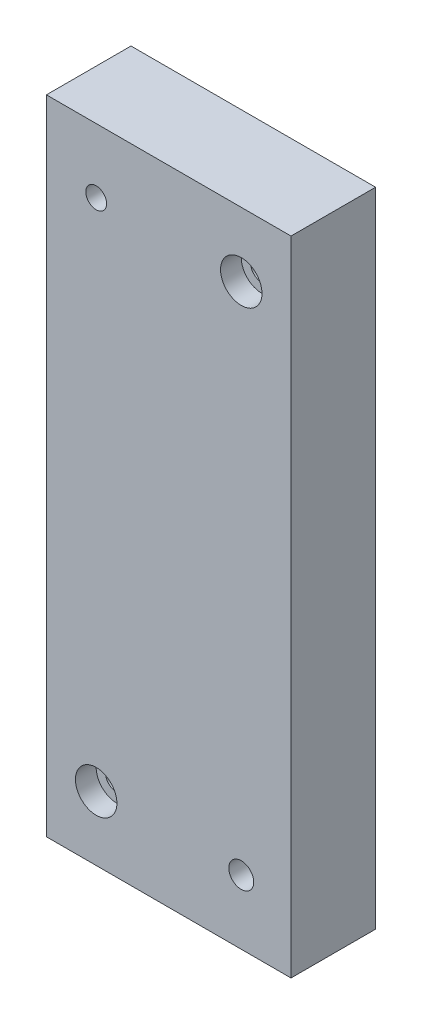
ISO-10303-21;
HEADER;
FILE_DESCRIPTION(('STEP AP214'),'2;1');
FILE_NAME('part.step','',(''),(''),'','','');
FILE_SCHEMA(('AUTOMOTIVE_DESIGN { 1 0 10303 214 1 1 1 1 }'));
ENDSEC;
DATA;
#1=APPLICATION_CONTEXT('core data for automotive mechanical design processes');
#2=APPLICATION_PROTOCOL_DEFINITION('international standard','automotive_design',2000,#1);
#3=PRODUCT_CONTEXT('',#1,'mechanical');
#4=PRODUCT('Part','Part','',(#3));
#5=PRODUCT_RELATED_PRODUCT_CATEGORY('part','',(#4));
#6=PRODUCT_DEFINITION_FORMATION('','',#4);
#7=PRODUCT_DEFINITION_CONTEXT('part definition',#1,'design');
#8=PRODUCT_DEFINITION('design','',#6,#7);
#9=PRODUCT_DEFINITION_SHAPE('','',#8);
#10=(LENGTH_UNIT() NAMED_UNIT(*) SI_UNIT(.MILLI.,.METRE.));
#11=(NAMED_UNIT(*) PLANE_ANGLE_UNIT() SI_UNIT($,.RADIAN.));
#12=(NAMED_UNIT(*) SI_UNIT($,.STERADIAN.) SOLID_ANGLE_UNIT());
#13=UNCERTAINTY_MEASURE_WITH_UNIT(LENGTH_MEASURE(1.E-05),#10,'distance_accuracy_value','');
#14=(GEOMETRIC_REPRESENTATION_CONTEXT(3) GLOBAL_UNCERTAINTY_ASSIGNED_CONTEXT((#13)) GLOBAL_UNIT_ASSIGNED_CONTEXT((#10,
#11,#12)) REPRESENTATION_CONTEXT('',''));
#15=CARTESIAN_POINT('',(0.,0.,0.));
#16=DIRECTION('',(0.,0.,1.));
#17=DIRECTION('',(1.,0.,0.));
#18=AXIS2_PLACEMENT_3D('',#15,#16,#17);
#19=CARTESIAN_POINT('',(29.5,77.5,20.4));
#20=DIRECTION('',(0.,0.,1.));
#21=DIRECTION('',(1.,0.,0.));
#22=AXIS2_PLACEMENT_3D('',#19,#20,#21);
#23=PLANE('',#22);
#24=CARTESIAN_POINT('',(17.5,62.,20.4));
#25=DIRECTION('',(0.,0.,1.));
#26=DIRECTION('',(1.,0.,0.));
#27=AXIS2_PLACEMENT_3D('',#24,#25,#26);
#28=CIRCLE('',#27,4.99999999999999);
#29=CARTESIAN_POINT('',(22.5,62.,20.4));
#30=VERTEX_POINT('',#29);
#31=EDGE_CURVE('E138',#30,#30,#28,.T.);
#32=ORIENTED_EDGE('',*,*,#31,.F.);
#33=EDGE_LOOP('',(#32));
#34=FACE_BOUND('',#33,.T.);
#35=CARTESIAN_POINT('',(-17.5,-62.,20.4));
#36=DIRECTION('',(0.,0.,1.));
#37=DIRECTION('',(1.,0.,0.));
#38=AXIS2_PLACEMENT_3D('',#35,#36,#37);
#39=CIRCLE('',#38,4.99999999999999);
#40=CARTESIAN_POINT('',(-12.5,-62.,20.4));
#41=VERTEX_POINT('',#40);
#42=EDGE_CURVE('E124',#41,#41,#39,.T.);
#43=ORIENTED_EDGE('',*,*,#42,.F.);
#44=EDGE_LOOP('',(#43));
#45=FACE_BOUND('',#44,.T.);
#46=CARTESIAN_POINT('',(-17.5,62.,20.4));
#47=DIRECTION('',(0.,0.,1.));
#48=DIRECTION('',(1.,0.,0.));
#49=AXIS2_PLACEMENT_3D('',#46,#47,#48);
#50=CIRCLE('',#49,2.5035);
#51=CARTESIAN_POINT('',(-14.9965,62.,20.4));
#52=VERTEX_POINT('',#51);
#53=EDGE_CURVE('E90',#52,#52,#50,.T.);
#54=ORIENTED_EDGE('',*,*,#53,.F.);
#55=EDGE_LOOP('',(#54));
#56=FACE_BOUND('',#55,.T.);
#57=DIRECTION('',(0.,1.,0.));
#58=VECTOR('',#57,1.);
#59=CARTESIAN_POINT('',(29.5,-77.5,20.4));
#60=LINE('',#59,#58);
#61=CARTESIAN_POINT('',(29.5,-77.5,20.4));
#62=VERTEX_POINT('',#61);
#63=CARTESIAN_POINT('',(29.5,77.5,20.4));
#64=VERTEX_POINT('',#63);
#65=EDGE_CURVE('E100',#62,#64,#60,.T.);
#66=ORIENTED_EDGE('',*,*,#65,.T.);
#67=DIRECTION('',(-1.,0.,0.));
#68=VECTOR('',#67,1.);
#69=CARTESIAN_POINT('',(29.5,77.5,20.4));
#70=LINE('',#69,#68);
#71=CARTESIAN_POINT('',(-29.5,77.5,20.4));
#72=VERTEX_POINT('',#71);
#73=EDGE_CURVE('E85',#64,#72,#70,.T.);
#74=ORIENTED_EDGE('',*,*,#73,.T.);
#75=DIRECTION('',(0.,-1.,0.));
#76=VECTOR('',#75,1.);
#77=CARTESIAN_POINT('',(-29.5,-77.5,20.4));
#78=LINE('',#77,#76);
#79=CARTESIAN_POINT('',(-29.5,-77.5,20.4));
#80=VERTEX_POINT('',#79);
#81=EDGE_CURVE('E51',#72,#80,#78,.T.);
#82=ORIENTED_EDGE('',*,*,#81,.T.);
#83=DIRECTION('',(1.,0.,0.));
#84=VECTOR('',#83,1.);
#85=CARTESIAN_POINT('',(-29.5,-77.5,20.4));
#86=LINE('',#85,#84);
#87=EDGE_CURVE('E46',#80,#62,#86,.T.);
#88=ORIENTED_EDGE('',*,*,#87,.T.);
#89=EDGE_LOOP('',(#66,#74,#82,#88));
#90=FACE_BOUND('',#89,.T.);
#91=CARTESIAN_POINT('',(17.5,-62.,20.4));
#92=DIRECTION('',(0.,0.,1.));
#93=DIRECTION('',(1.,0.,0.));
#94=AXIS2_PLACEMENT_3D('',#91,#92,#93);
#95=CIRCLE('',#94,3.0035);
#96=CARTESIAN_POINT('',(20.5035,-62.,20.4));
#97=VERTEX_POINT('',#96);
#98=EDGE_CURVE('E118',#97,#97,#95,.T.);
#99=ORIENTED_EDGE('',*,*,#98,.F.);
#100=EDGE_LOOP('',(#99));
#101=FACE_BOUND('',#100,.T.);
#102=ADVANCED_FACE('F31',(#34,#45,#56,#90,#101),#23,.T.);
#103=CARTESIAN_POINT('',(29.5,77.5,0.));
#104=DIRECTION('',(0.,0.,1.));
#105=DIRECTION('',(1.,0.,0.));
#106=AXIS2_PLACEMENT_3D('',#103,#104,#105);
#107=PLANE('',#106);
#108=CARTESIAN_POINT('',(17.5,62.,0.));
#109=DIRECTION('',(0.,0.,1.));
#110=DIRECTION('',(1.,0.,0.));
#111=AXIS2_PLACEMENT_3D('',#108,#109,#110);
#112=CIRCLE('',#111,2.75);
#113=CARTESIAN_POINT('',(20.25,62.,0.));
#114=VERTEX_POINT('',#113);
#115=EDGE_CURVE('E147',#114,#114,#112,.T.);
#116=ORIENTED_EDGE('',*,*,#115,.T.);
#117=EDGE_LOOP('',(#116));
#118=FACE_BOUND('',#117,.T.);
#119=CARTESIAN_POINT('',(-17.5,-62.,0.));
#120=DIRECTION('',(0.,0.,1.));
#121=DIRECTION('',(1.,0.,0.));
#122=AXIS2_PLACEMENT_3D('',#119,#120,#121);
#123=CIRCLE('',#122,2.75);
#124=CARTESIAN_POINT('',(-14.75,-62.,0.));
#125=VERTEX_POINT('',#124);
#126=EDGE_CURVE('E135',#125,#125,#123,.T.);
#127=ORIENTED_EDGE('',*,*,#126,.T.);
#128=EDGE_LOOP('',(#127));
#129=FACE_BOUND('',#128,.T.);
#130=CARTESIAN_POINT('',(-17.5,62.,0.));
#131=DIRECTION('',(0.,0.,1.));
#132=DIRECTION('',(1.,0.,0.));
#133=AXIS2_PLACEMENT_3D('',#130,#131,#132);
#134=CIRCLE('',#133,2.5035);
#135=CARTESIAN_POINT('',(-14.9965,62.,0.));
#136=VERTEX_POINT('',#135);
#137=EDGE_CURVE('E93',#136,#136,#134,.T.);
#138=ORIENTED_EDGE('',*,*,#137,.T.);
#139=EDGE_LOOP('',(#138));
#140=FACE_BOUND('',#139,.T.);
#141=DIRECTION('',(0.,1.,0.));
#142=VECTOR('',#141,1.);
#143=CARTESIAN_POINT('',(29.5,-77.5,0.));
#144=LINE('',#143,#142);
#145=CARTESIAN_POINT('',(29.5,-77.5,0.));
#146=VERTEX_POINT('',#145);
#147=CARTESIAN_POINT('',(29.5,77.5,0.));
#148=VERTEX_POINT('',#147);
#149=EDGE_CURVE('E77',#146,#148,#144,.T.);
#150=ORIENTED_EDGE('',*,*,#149,.F.);
#151=DIRECTION('',(1.,0.,0.));
#152=VECTOR('',#151,1.);
#153=CARTESIAN_POINT('',(-29.5,-77.5,0.));
#154=LINE('',#153,#152);
#155=CARTESIAN_POINT('',(-29.5,-77.5,0.));
#156=VERTEX_POINT('',#155);
#157=EDGE_CURVE('E98',#156,#146,#154,.T.);
#158=ORIENTED_EDGE('',*,*,#157,.F.);
#159=DIRECTION('',(0.,-1.,0.));
#160=VECTOR('',#159,1.);
#161=CARTESIAN_POINT('',(-29.5,-77.5,0.));
#162=LINE('',#161,#160);
#163=CARTESIAN_POINT('',(-29.5,77.5,0.));
#164=VERTEX_POINT('',#163);
#165=EDGE_CURVE('E78',#164,#156,#162,.T.);
#166=ORIENTED_EDGE('',*,*,#165,.F.);
#167=DIRECTION('',(-1.,0.,0.));
#168=VECTOR('',#167,1.);
#169=CARTESIAN_POINT('',(29.5,77.5,0.));
#170=LINE('',#169,#168);
#171=EDGE_CURVE('E72',#148,#164,#170,.T.);
#172=ORIENTED_EDGE('',*,*,#171,.F.);
#173=EDGE_LOOP('',(#150,#158,#166,#172));
#174=FACE_BOUND('',#173,.T.);
#175=CARTESIAN_POINT('',(17.5,-62.,0.));
#176=DIRECTION('',(0.,0.,1.));
#177=DIRECTION('',(1.,0.,0.));
#178=AXIS2_PLACEMENT_3D('',#175,#176,#177);
#179=CIRCLE('',#178,3.0035);
#180=CARTESIAN_POINT('',(20.5035,-62.,0.));
#181=VERTEX_POINT('',#180);
#182=EDGE_CURVE('E120',#181,#181,#179,.T.);
#183=ORIENTED_EDGE('',*,*,#182,.T.);
#184=EDGE_LOOP('',(#183));
#185=FACE_BOUND('',#184,.T.);
#186=ADVANCED_FACE('F73',(#118,#129,#140,#174,#185),#107,.F.);
#187=CARTESIAN_POINT('',(29.5,-77.5,20.4));
#188=DIRECTION('',(-1.,0.,0.));
#189=DIRECTION('',(0.,0.,1.));
#190=AXIS2_PLACEMENT_3D('',#187,#188,#189);
#191=PLANE('',#190);
#192=ORIENTED_EDGE('',*,*,#149,.T.);
#193=DIRECTION('',(0.,0.,-1.));
#194=VECTOR('',#193,1.);
#195=CARTESIAN_POINT('',(29.5,77.5,20.4));
#196=LINE('',#195,#194);
#197=EDGE_CURVE('E11',#64,#148,#196,.T.);
#198=ORIENTED_EDGE('',*,*,#197,.F.);
#199=ORIENTED_EDGE('',*,*,#65,.F.);
#200=DIRECTION('',(0.,0.,-1.));
#201=VECTOR('',#200,1.);
#202=CARTESIAN_POINT('',(29.5,-77.5,20.4));
#203=LINE('',#202,#201);
#204=EDGE_CURVE('E89',#62,#146,#203,.T.);
#205=ORIENTED_EDGE('',*,*,#204,.T.);
#206=EDGE_LOOP('',(#192,#198,#199,#205));
#207=FACE_BOUND('',#206,.T.);
#208=ADVANCED_FACE('F33',(#207),#191,.F.);
#209=CARTESIAN_POINT('',(29.5,77.5,20.4));
#210=DIRECTION('',(0.,-1.,0.));
#211=DIRECTION('',(0.,0.,-1.));
#212=AXIS2_PLACEMENT_3D('',#209,#210,#211);
#213=PLANE('',#212);
#214=ORIENTED_EDGE('',*,*,#171,.T.);
#215=DIRECTION('',(0.,0.,-1.));
#216=VECTOR('',#215,1.);
#217=CARTESIAN_POINT('',(-29.5,77.5,20.4));
#218=LINE('',#217,#216);
#219=EDGE_CURVE('E39',#72,#164,#218,.T.);
#220=ORIENTED_EDGE('',*,*,#219,.F.);
#221=ORIENTED_EDGE('',*,*,#73,.F.);
#222=ORIENTED_EDGE('',*,*,#197,.T.);
#223=EDGE_LOOP('',(#214,#220,#221,#222));
#224=FACE_BOUND('',#223,.T.);
#225=ADVANCED_FACE('F84',(#224),#213,.F.);
#226=CARTESIAN_POINT('',(-29.5,-77.5,20.4));
#227=DIRECTION('',(1.,0.,0.));
#228=DIRECTION('',(0.,0.,-1.));
#229=AXIS2_PLACEMENT_3D('',#226,#227,#228);
#230=PLANE('',#229);
#231=ORIENTED_EDGE('',*,*,#165,.T.);
#232=DIRECTION('',(0.,0.,-1.));
#233=VECTOR('',#232,1.);
#234=CARTESIAN_POINT('',(-29.5,-77.5,20.4));
#235=LINE('',#234,#233);
#236=EDGE_CURVE('E106',#80,#156,#235,.T.);
#237=ORIENTED_EDGE('',*,*,#236,.F.);
#238=ORIENTED_EDGE('',*,*,#81,.F.);
#239=ORIENTED_EDGE('',*,*,#219,.T.);
#240=EDGE_LOOP('',(#231,#237,#238,#239));
#241=FACE_BOUND('',#240,.T.);
#242=ADVANCED_FACE('F109',(#241),#230,.F.);
#243=CARTESIAN_POINT('',(-29.5,-77.5,20.4));
#244=DIRECTION('',(0.,1.,0.));
#245=DIRECTION('',(0.,0.,1.));
#246=AXIS2_PLACEMENT_3D('',#243,#244,#245);
#247=PLANE('',#246);
#248=ORIENTED_EDGE('',*,*,#157,.T.);
#249=ORIENTED_EDGE('',*,*,#204,.F.);
#250=ORIENTED_EDGE('',*,*,#87,.F.);
#251=ORIENTED_EDGE('',*,*,#236,.T.);
#252=EDGE_LOOP('',(#248,#249,#250,#251));
#253=FACE_BOUND('',#252,.T.);
#254=ADVANCED_FACE('F111',(#253),#247,.F.);
#255=CARTESIAN_POINT('',(-17.5,62.,20.4));
#256=DIRECTION('',(0.,0.,-1.));
#257=DIRECTION('',(-1.,0.,0.));
#258=AXIS2_PLACEMENT_3D('',#255,#256,#257);
#259=CYLINDRICAL_SURFACE('',#258,2.5035);
#260=ORIENTED_EDGE('',*,*,#53,.T.);
#261=EDGE_LOOP('',(#260));
#262=FACE_BOUND('',#261,.T.);
#263=ORIENTED_EDGE('',*,*,#137,.F.);
#264=EDGE_LOOP('',(#263));
#265=FACE_BOUND('',#264,.T.);
#266=ADVANCED_FACE('F176',(#262,#265),#259,.F.);
#267=CARTESIAN_POINT('',(17.5,-62.,20.4));
#268=DIRECTION('',(0.,0.,-1.));
#269=DIRECTION('',(-1.,0.,0.));
#270=AXIS2_PLACEMENT_3D('',#267,#268,#269);
#271=CYLINDRICAL_SURFACE('',#270,3.0035);
#272=ORIENTED_EDGE('',*,*,#98,.T.);
#273=EDGE_LOOP('',(#272));
#274=FACE_BOUND('',#273,.T.);
#275=ORIENTED_EDGE('',*,*,#182,.F.);
#276=EDGE_LOOP('',(#275));
#277=FACE_BOUND('',#276,.T.);
#278=ADVANCED_FACE('F179',(#274,#277),#271,.F.);
#279=CARTESIAN_POINT('',(-17.5,-62.,20.4));
#280=DIRECTION('',(0.,0.,1.));
#281=DIRECTION('',(1.,0.,0.));
#282=AXIS2_PLACEMENT_3D('',#279,#280,#281);
#283=CYLINDRICAL_SURFACE('',#282,4.99999999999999);
#284=CARTESIAN_POINT('',(-17.5,-62.,15.4));
#285=DIRECTION('',(0.,0.,1.));
#286=DIRECTION('',(1.,0.,0.));
#287=AXIS2_PLACEMENT_3D('',#284,#285,#286);
#288=CIRCLE('',#287,4.99999999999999);
#289=CARTESIAN_POINT('',(-12.5,-62.,15.4));
#290=VERTEX_POINT('',#289);
#291=EDGE_CURVE('E129',#290,#290,#288,.T.);
#292=ORIENTED_EDGE('',*,*,#291,.F.);
#293=EDGE_LOOP('',(#292));
#294=FACE_BOUND('',#293,.T.);
#295=ORIENTED_EDGE('',*,*,#42,.T.);
#296=EDGE_LOOP('',(#295));
#297=FACE_BOUND('',#296,.T.);
#298=ADVANCED_FACE('F216',(#294,#297),#283,.F.);
#299=CARTESIAN_POINT('',(-14.75,-62.,15.4));
#300=DIRECTION('',(0.,0.,-1.));
#301=DIRECTION('',(-1.,0.,0.));
#302=AXIS2_PLACEMENT_3D('',#299,#300,#301);
#303=PLANE('',#302);
#304=CARTESIAN_POINT('',(-17.5,-62.,15.4));
#305=DIRECTION('',(0.,0.,1.));
#306=DIRECTION('',(1.,0.,0.));
#307=AXIS2_PLACEMENT_3D('',#304,#305,#306);
#308=CIRCLE('',#307,2.75000000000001);
#309=CARTESIAN_POINT('',(-14.75,-62.,15.4));
#310=VERTEX_POINT('',#309);
#311=EDGE_CURVE('E132',#310,#310,#308,.T.);
#312=ORIENTED_EDGE('',*,*,#311,.F.);
#313=EDGE_LOOP('',(#312));
#314=FACE_BOUND('',#313,.T.);
#315=ORIENTED_EDGE('',*,*,#291,.T.);
#316=EDGE_LOOP('',(#315));
#317=FACE_BOUND('',#316,.T.);
#318=ADVANCED_FACE('F223',(#314,#317),#303,.F.);
#319=CARTESIAN_POINT('',(-17.5,-62.,20.4));
#320=DIRECTION('',(0.,0.,1.));
#321=DIRECTION('',(1.,0.,0.));
#322=AXIS2_PLACEMENT_3D('',#319,#320,#321);
#323=CYLINDRICAL_SURFACE('',#322,2.75);
#324=ORIENTED_EDGE('',*,*,#126,.F.);
#325=EDGE_LOOP('',(#324));
#326=FACE_BOUND('',#325,.T.);
#327=ORIENTED_EDGE('',*,*,#311,.T.);
#328=EDGE_LOOP('',(#327));
#329=FACE_BOUND('',#328,.T.);
#330=ADVANCED_FACE('F168',(#326,#329),#323,.F.);
#331=CARTESIAN_POINT('',(17.5,62.,20.4));
#332=DIRECTION('',(0.,0.,1.));
#333=DIRECTION('',(1.,0.,0.));
#334=AXIS2_PLACEMENT_3D('',#331,#332,#333);
#335=CYLINDRICAL_SURFACE('',#334,4.99999999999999);
#336=CARTESIAN_POINT('',(17.5,62.,15.4));
#337=DIRECTION('',(0.,0.,1.));
#338=DIRECTION('',(1.,0.,0.));
#339=AXIS2_PLACEMENT_3D('',#336,#337,#338);
#340=CIRCLE('',#339,4.99999999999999);
#341=CARTESIAN_POINT('',(22.5,62.,15.4));
#342=VERTEX_POINT('',#341);
#343=EDGE_CURVE('E141',#342,#342,#340,.T.);
#344=ORIENTED_EDGE('',*,*,#343,.F.);
#345=EDGE_LOOP('',(#344));
#346=FACE_BOUND('',#345,.T.);
#347=ORIENTED_EDGE('',*,*,#31,.T.);
#348=EDGE_LOOP('',(#347));
#349=FACE_BOUND('',#348,.T.);
#350=ADVANCED_FACE('F162',(#346,#349),#335,.F.);
#351=CARTESIAN_POINT('',(20.25,62.,15.4));
#352=DIRECTION('',(0.,0.,-1.));
#353=DIRECTION('',(-1.,0.,0.));
#354=AXIS2_PLACEMENT_3D('',#351,#352,#353);
#355=PLANE('',#354);
#356=CARTESIAN_POINT('',(17.5,62.,15.4));
#357=DIRECTION('',(0.,0.,1.));
#358=DIRECTION('',(1.,0.,0.));
#359=AXIS2_PLACEMENT_3D('',#356,#357,#358);
#360=CIRCLE('',#359,2.75000000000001);
#361=CARTESIAN_POINT('',(20.25,62.,15.4));
#362=VERTEX_POINT('',#361);
#363=EDGE_CURVE('E144',#362,#362,#360,.T.);
#364=ORIENTED_EDGE('',*,*,#363,.F.);
#365=EDGE_LOOP('',(#364));
#366=FACE_BOUND('',#365,.T.);
#367=ORIENTED_EDGE('',*,*,#343,.T.);
#368=EDGE_LOOP('',(#367));
#369=FACE_BOUND('',#368,.T.);
#370=ADVANCED_FACE('F156',(#366,#369),#355,.F.);
#371=CARTESIAN_POINT('',(17.5,62.,20.4));
#372=DIRECTION('',(0.,0.,1.));
#373=DIRECTION('',(1.,0.,0.));
#374=AXIS2_PLACEMENT_3D('',#371,#372,#373);
#375=CYLINDRICAL_SURFACE('',#374,2.75);
#376=ORIENTED_EDGE('',*,*,#115,.F.);
#377=EDGE_LOOP('',(#376));
#378=FACE_BOUND('',#377,.T.);
#379=ORIENTED_EDGE('',*,*,#363,.T.);
#380=EDGE_LOOP('',(#379));
#381=FACE_BOUND('',#380,.T.);
#382=ADVANCED_FACE('F153',(#378,#381),#375,.F.);
#383=CLOSED_SHELL('',(#102,#186,#208,#225,#242,#254,#266,#278,#298,#318,#330,#350,#370,#382));
#384=MANIFOLD_SOLID_BREP('B2',#383);
#385=ADVANCED_BREP_SHAPE_REPRESENTATION('',(#18,#384),#14);
#386=SHAPE_DEFINITION_REPRESENTATION(#9,#385);
ENDSEC;
END-ISO-10303-21;
